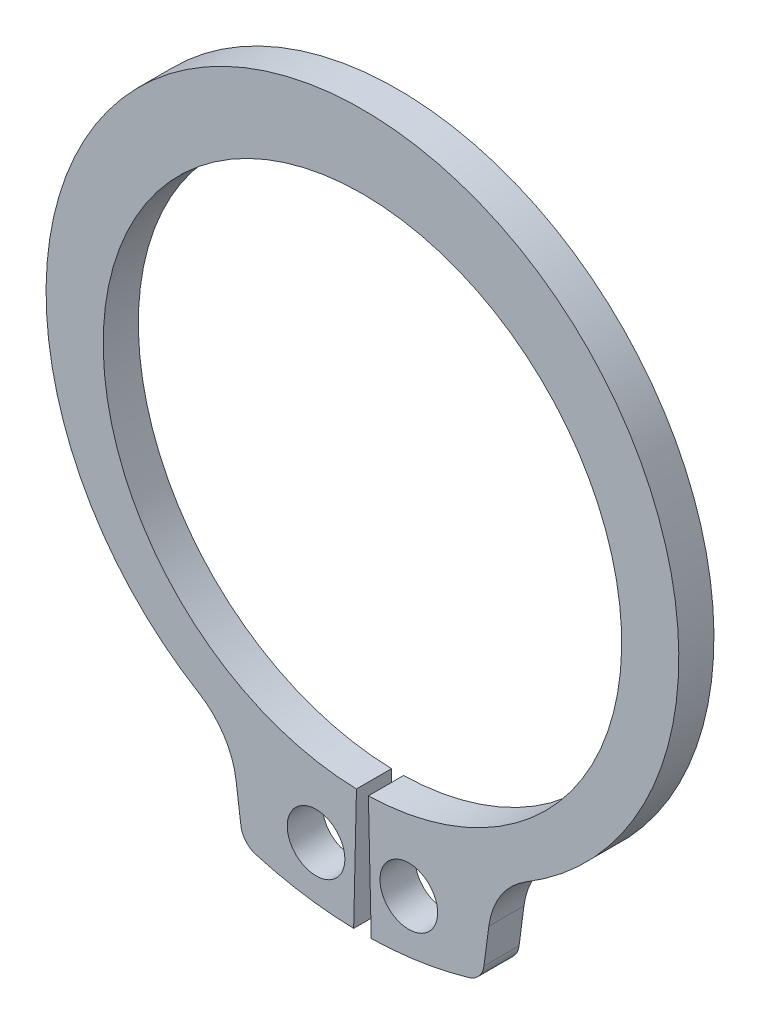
from build123d import *

# Parameters (mm, degrees)
BODYSKE_R  = 0.5207
BODY_DEPTH = 0.635


with BuildPart() as part:
    # BodySke → Body (new body)
    with BuildSketch(Plane.XY):
        with BuildLine():
            Line((0.107879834, -4.685058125), (0.15875, -6.894272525))
            ThreePointArc((0.15875, -6.894272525), (1.050894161, -6.81555696), (1.925313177, -6.621885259))
            ThreePointArc((1.925313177, -6.621885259), (2.108033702, -6.504202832), (2.196682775, -6.305765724))
            Line((2.196682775, -6.305765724), (2.284680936, -5.637353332))
            ThreePointArc((2.284680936, -5.637353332), (2.504256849, -5.044910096), (2.958817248, -4.606073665))
            ThreePointArc((2.958817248, -4.606073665), (0, 6.0071), (-2.958817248, -4.606073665))
            ThreePointArc((-2.958817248, -4.606073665), (-2.504256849, -5.044910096), (-2.284680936, -5.637353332))
            Line((-2.284680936, -5.637353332), (-2.196682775, -6.305765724))
            ThreePointArc((-2.196682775, -6.305765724), (-2.108033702, -6.504202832), (-1.925313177, -6.621885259))
            ThreePointArc((-1.925313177, -6.621885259), (-1.050894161, -6.81555696), (-0.15875, -6.894272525))
            Line((-0.15875, -6.894272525), (-0.107879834, -4.685058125))
            ThreePointArc((-0.107879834, -4.685058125), (0, 4.6863), (0.107879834, -4.685058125))
        make_face()
        with Locations((0.8382, -5.89061336)):
            Circle(BODYSKE_R, mode=Mode.SUBTRACT)
        with Locations((-0.8382, -5.89061336)):
            Circle(BODYSKE_R, mode=Mode.SUBTRACT)
    extrude(amount=-BODY_DEPTH)


solid = part.part
